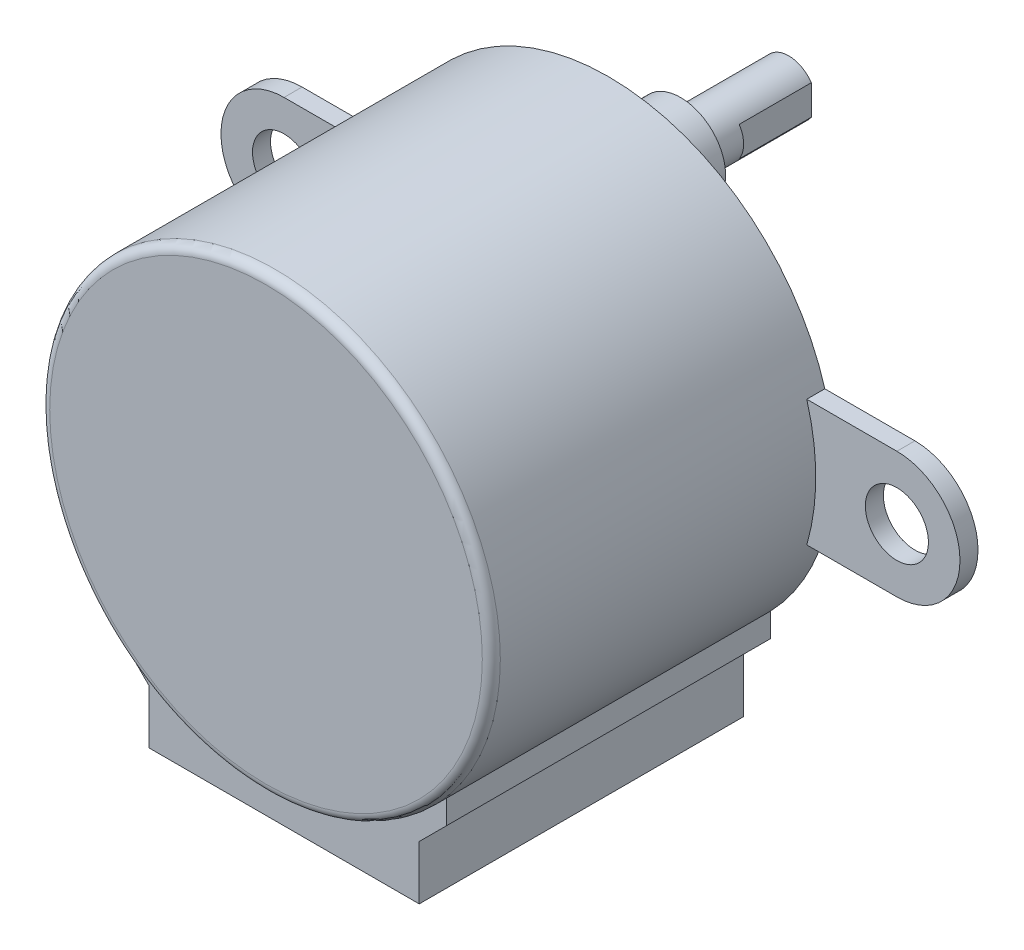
ISO-10303-21;
HEADER;
FILE_DESCRIPTION(('STEP AP214'),'2;1');
FILE_NAME('part.step','',(''),(''),'','','');
FILE_SCHEMA(('AUTOMOTIVE_DESIGN { 1 0 10303 214 1 1 1 1 }'));
ENDSEC;
DATA;
#1=APPLICATION_CONTEXT('core data for automotive mechanical design processes');
#2=APPLICATION_PROTOCOL_DEFINITION('international standard','automotive_design',2000,#1);
#3=PRODUCT_CONTEXT('',#1,'mechanical');
#4=PRODUCT('Part','Part','',(#3));
#5=PRODUCT_RELATED_PRODUCT_CATEGORY('part','',(#4));
#6=PRODUCT_DEFINITION_FORMATION('','',#4);
#7=PRODUCT_DEFINITION_CONTEXT('part definition',#1,'design');
#8=PRODUCT_DEFINITION('design','',#6,#7);
#9=PRODUCT_DEFINITION_SHAPE('','',#8);
#10=(LENGTH_UNIT() NAMED_UNIT(*) SI_UNIT(.MILLI.,.METRE.));
#11=(NAMED_UNIT(*) PLANE_ANGLE_UNIT() SI_UNIT($,.RADIAN.));
#12=(NAMED_UNIT(*) SI_UNIT($,.STERADIAN.) SOLID_ANGLE_UNIT());
#13=UNCERTAINTY_MEASURE_WITH_UNIT(LENGTH_MEASURE(1.E-05),#10,'distance_accuracy_value','');
#14=(GEOMETRIC_REPRESENTATION_CONTEXT(3) GLOBAL_UNCERTAINTY_ASSIGNED_CONTEXT((#13)) GLOBAL_UNIT_ASSIGNED_CONTEXT((#10,
#11,#12)) REPRESENTATION_CONTEXT('',''));
#15=CARTESIAN_POINT('',(0.,0.,0.));
#16=DIRECTION('',(0.,0.,1.));
#17=DIRECTION('',(1.,0.,0.));
#18=AXIS2_PLACEMENT_3D('',#15,#16,#17);
#19=CARTESIAN_POINT('',(0.,7.,-4.));
#20=DIRECTION('',(0.,0.,-1.));
#21=DIRECTION('',(-1.,0.,0.));
#22=AXIS2_PLACEMENT_3D('',#19,#20,#21);
#23=PLANE('',#22);
#24=CARTESIAN_POINT('',(0.,7.,-4.));
#25=DIRECTION('',(0.,0.,-1.));
#26=DIRECTION('',(-1.,0.,0.));
#27=AXIS2_PLACEMENT_3D('',#24,#25,#26);
#28=CIRCLE('',#27,2.5);
#29=CARTESIAN_POINT('',(-2.5,7.,-4.));
#30=VERTEX_POINT('',#29);
#31=EDGE_CURVE('E193',#30,#30,#28,.T.);
#32=ORIENTED_EDGE('',*,*,#31,.T.);
#33=EDGE_LOOP('',(#32));
#34=FACE_BOUND('',#33,.T.);
#35=CARTESIAN_POINT('',(0.,7.,-4.));
#36=DIRECTION('',(0.,0.,-1.));
#37=DIRECTION('',(-1.,0.,0.));
#38=AXIS2_PLACEMENT_3D('',#35,#36,#37);
#39=CIRCLE('',#38,1.5);
#40=CARTESIAN_POINT('',(-1.5,7.,-4.));
#41=VERTEX_POINT('',#40);
#42=EDGE_CURVE('E195',#41,#41,#39,.T.);
#43=ORIENTED_EDGE('',*,*,#42,.F.);
#44=EDGE_LOOP('',(#43));
#45=FACE_BOUND('',#44,.T.);
#46=ADVANCED_FACE('F33',(#34,#45),#23,.T.);
#47=CARTESIAN_POINT('',(0.,7.,-1.));
#48=DIRECTION('',(0.,0.,-1.));
#49=DIRECTION('',(-1.,0.,0.));
#50=AXIS2_PLACEMENT_3D('',#47,#48,#49);
#51=PLANE('',#50);
#52=CARTESIAN_POINT('',(0.,7.,-1.));
#53=DIRECTION('',(0.,0.,-1.));
#54=DIRECTION('',(-1.,0.,0.));
#55=AXIS2_PLACEMENT_3D('',#52,#53,#54);
#56=CIRCLE('',#55,3.);
#57=CARTESIAN_POINT('',(-3.,7.,-1.));
#58=VERTEX_POINT('',#57);
#59=EDGE_CURVE('E201',#58,#58,#56,.T.);
#60=ORIENTED_EDGE('',*,*,#59,.T.);
#61=EDGE_LOOP('',(#60));
#62=FACE_BOUND('',#61,.T.);
#63=CARTESIAN_POINT('',(0.,7.,-1.));
#64=DIRECTION('',(0.,0.,-1.));
#65=DIRECTION('',(-1.,0.,0.));
#66=AXIS2_PLACEMENT_3D('',#63,#64,#65);
#67=CIRCLE('',#66,2.5);
#68=CARTESIAN_POINT('',(-2.5,7.,-1.));
#69=VERTEX_POINT('',#68);
#70=EDGE_CURVE('E189',#69,#69,#67,.T.);
#71=ORIENTED_EDGE('',*,*,#70,.F.);
#72=EDGE_LOOP('',(#71));
#73=FACE_BOUND('',#72,.T.);
#74=ADVANCED_FACE('F371',(#62,#73),#51,.T.);
#75=CARTESIAN_POINT('',(0.,0.,0.));
#76=DIRECTION('',(0.,0.,1.));
#77=DIRECTION('',(1.,0.,0.));
#78=AXIS2_PLACEMENT_3D('',#75,#76,#77);
#79=PLANE('',#78);
#80=CARTESIAN_POINT('',(17.,0.,0.));
#81=DIRECTION('',(0.,0.,1.));
#82=DIRECTION('',(1.,0.,0.));
#83=AXIS2_PLACEMENT_3D('',#80,#81,#82);
#84=CIRCLE('',#83,1.75);
#85=CARTESIAN_POINT('',(18.75,0.,0.));
#86=VERTEX_POINT('',#85);
#87=EDGE_CURVE('E204',#86,#86,#84,.T.);
#88=ORIENTED_EDGE('',*,*,#87,.T.);
#89=EDGE_LOOP('',(#88));
#90=FACE_BOUND('',#89,.T.);
#91=CARTESIAN_POINT('',(-17.,0.,0.));
#92=DIRECTION('',(0.,0.,-1.));
#93=DIRECTION('',(-1.,0.,0.));
#94=AXIS2_PLACEMENT_3D('',#91,#92,#93);
#95=CIRCLE('',#94,1.75);
#96=CARTESIAN_POINT('',(-18.75,0.,0.));
#97=VERTEX_POINT('',#96);
#98=EDGE_CURVE('E233',#97,#97,#95,.T.);
#99=ORIENTED_EDGE('',*,*,#98,.F.);
#100=EDGE_LOOP('',(#99));
#101=FACE_BOUND('',#100,.T.);
#102=CARTESIAN_POINT('',(0.,0.,0.));
#103=DIRECTION('',(0.,0.,1.));
#104=DIRECTION('',(1.,0.,0.));
#105=AXIS2_PLACEMENT_3D('',#102,#103,#104);
#106=CIRCLE('',#105,12.5);
#107=CARTESIAN_POINT('',(9.,-8.67467578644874,0.));
#108=VERTEX_POINT('',#107);
#109=CARTESIAN_POINT('',(12.,-3.5,0.));
#110=VERTEX_POINT('',#109);
#111=EDGE_CURVE('E340',#108,#110,#106,.T.);
#112=ORIENTED_EDGE('',*,*,#111,.F.);
#113=DIRECTION('',(0.,-1.,0.));
#114=VECTOR('',#113,1.);
#115=CARTESIAN_POINT('',(9.,-8.67467578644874,0.));
#116=LINE('',#115,#114);
#117=CARTESIAN_POINT('',(9.,-10.,0.));
#118=VERTEX_POINT('',#117);
#119=EDGE_CURVE('E278',#108,#118,#116,.T.);
#120=ORIENTED_EDGE('',*,*,#119,.T.);
#121=DIRECTION('',(-0.707106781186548,-0.707106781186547,0.));
#122=VECTOR('',#121,1.);
#123=CARTESIAN_POINT('',(9.,-10.,0.));
#124=LINE('',#123,#122);
#125=CARTESIAN_POINT('',(7.5,-11.5,0.));
#126=VERTEX_POINT('',#125);
#127=EDGE_CURVE('E270',#118,#126,#124,.T.);
#128=ORIENTED_EDGE('',*,*,#127,.T.);
#129=DIRECTION('',(0.,-1.,0.));
#130=VECTOR('',#129,1.);
#131=CARTESIAN_POINT('',(7.5,-11.5,0.));
#132=LINE('',#131,#130);
#133=CARTESIAN_POINT('',(7.5,-14.5,0.));
#134=VERTEX_POINT('',#133);
#135=EDGE_CURVE('E294',#126,#134,#132,.T.);
#136=ORIENTED_EDGE('',*,*,#135,.T.);
#137=DIRECTION('',(-1.,0.,0.));
#138=VECTOR('',#137,1.);
#139=CARTESIAN_POINT('',(7.5,-14.5,0.));
#140=LINE('',#139,#138);
#141=CARTESIAN_POINT('',(-7.5,-14.5,0.));
#142=VERTEX_POINT('',#141);
#143=EDGE_CURVE('E291',#134,#142,#140,.T.);
#144=ORIENTED_EDGE('',*,*,#143,.T.);
#145=DIRECTION('',(0.,1.,0.));
#146=VECTOR('',#145,1.);
#147=CARTESIAN_POINT('',(-7.5,-11.5,0.));
#148=LINE('',#147,#146);
#149=CARTESIAN_POINT('',(-7.5,-11.5,0.));
#150=VERTEX_POINT('',#149);
#151=EDGE_CURVE('E288',#142,#150,#148,.T.);
#152=ORIENTED_EDGE('',*,*,#151,.T.);
#153=DIRECTION('',(-0.707106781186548,0.707106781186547,0.));
#154=VECTOR('',#153,1.);
#155=CARTESIAN_POINT('',(-9.,-10.,0.));
#156=LINE('',#155,#154);
#157=CARTESIAN_POINT('',(-9.,-10.,0.));
#158=VERTEX_POINT('',#157);
#159=EDGE_CURVE('E285',#150,#158,#156,.T.);
#160=ORIENTED_EDGE('',*,*,#159,.T.);
#161=DIRECTION('',(0.,1.,0.));
#162=VECTOR('',#161,1.);
#163=CARTESIAN_POINT('',(-9.,-8.67467578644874,0.));
#164=LINE('',#163,#162);
#165=CARTESIAN_POINT('',(-9.,-8.67467578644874,0.));
#166=VERTEX_POINT('',#165);
#167=EDGE_CURVE('E282',#158,#166,#164,.T.);
#168=ORIENTED_EDGE('',*,*,#167,.T.);
#169=CARTESIAN_POINT('',(-12.,-3.50000000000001,0.));
#170=VERTEX_POINT('',#169);
#171=EDGE_CURVE('E339',#170,#166,#106,.T.);
#172=ORIENTED_EDGE('',*,*,#171,.F.);
#173=DIRECTION('',(-1.,0.,0.));
#174=VECTOR('',#173,1.);
#175=CARTESIAN_POINT('',(-17.,-3.5,0.));
#176=LINE('',#175,#174);
#177=CARTESIAN_POINT('',(-17.,-3.5,0.));
#178=VERTEX_POINT('',#177);
#179=EDGE_CURVE('E253',#170,#178,#176,.T.);
#180=ORIENTED_EDGE('',*,*,#179,.T.);
#181=CARTESIAN_POINT('',(-17.,0.,0.));
#182=DIRECTION('',(0.,0.,-1.));
#183=DIRECTION('',(-1.,0.,0.));
#184=AXIS2_PLACEMENT_3D('',#181,#182,#183);
#185=CIRCLE('',#184,3.5);
#186=CARTESIAN_POINT('',(-17.,3.5,0.));
#187=VERTEX_POINT('',#186);
#188=EDGE_CURVE('E247',#178,#187,#185,.T.);
#189=ORIENTED_EDGE('',*,*,#188,.T.);
#190=DIRECTION('',(1.,0.,0.));
#191=VECTOR('',#190,1.);
#192=CARTESIAN_POINT('',(-17.,3.5,0.));
#193=LINE('',#192,#191);
#194=CARTESIAN_POINT('',(-12.,3.5,0.));
#195=VERTEX_POINT('',#194);
#196=EDGE_CURVE('E250',#187,#195,#193,.T.);
#197=ORIENTED_EDGE('',*,*,#196,.T.);
#198=CARTESIAN_POINT('',(12.,3.5,0.));
#199=VERTEX_POINT('',#198);
#200=EDGE_CURVE('E343',#199,#195,#106,.T.);
#201=ORIENTED_EDGE('',*,*,#200,.F.);
#202=DIRECTION('',(-1.,0.,0.));
#203=VECTOR('',#202,1.);
#204=CARTESIAN_POINT('',(17.,3.5,0.));
#205=LINE('',#204,#203);
#206=CARTESIAN_POINT('',(17.,3.5,0.));
#207=VERTEX_POINT('',#206);
#208=EDGE_CURVE('E215',#207,#199,#205,.T.);
#209=ORIENTED_EDGE('',*,*,#208,.F.);
#210=CARTESIAN_POINT('',(17.,0.,0.));
#211=DIRECTION('',(0.,0.,1.));
#212=DIRECTION('',(1.,0.,0.));
#213=AXIS2_PLACEMENT_3D('',#210,#211,#212);
#214=CIRCLE('',#213,3.5);
#215=CARTESIAN_POINT('',(17.,-3.5,0.));
#216=VERTEX_POINT('',#215);
#217=EDGE_CURVE('E210',#216,#207,#214,.T.);
#218=ORIENTED_EDGE('',*,*,#217,.F.);
#219=DIRECTION('',(1.,0.,0.));
#220=VECTOR('',#219,1.);
#221=CARTESIAN_POINT('',(17.,-3.5,0.));
#222=LINE('',#221,#220);
#223=EDGE_CURVE('E213',#110,#216,#222,.T.);
#224=ORIENTED_EDGE('',*,*,#223,.F.);
#225=EDGE_LOOP('',(#112,#120,#128,#136,#144,#152,#160,#168,#172,#180,#189,#197,#201,#209,#218,#224));
#226=FACE_BOUND('',#225,.T.);
#227=CARTESIAN_POINT('',(0.,7.,0.));
#228=DIRECTION('',(0.,0.,1.));
#229=DIRECTION('',(1.,0.,0.));
#230=AXIS2_PLACEMENT_3D('',#227,#228,#229);
#231=CIRCLE('',#230,3.);
#232=CARTESIAN_POINT('',(3.,7.,0.));
#233=VERTEX_POINT('',#232);
#234=EDGE_CURVE('E12',#233,#233,#231,.F.);
#235=ORIENTED_EDGE('',*,*,#234,.F.);
#236=EDGE_LOOP('',(#235));
#237=FACE_BOUND('',#236,.T.);
#238=ADVANCED_FACE('F368',(#90,#101,#226,#237),#79,.F.);
#239=CARTESIAN_POINT('',(0.,0.,19.));
#240=DIRECTION('',(0.,0.,-1.));
#241=DIRECTION('',(-1.,0.,0.));
#242=AXIS2_PLACEMENT_3D('',#239,#240,#241);
#243=CYLINDRICAL_SURFACE('',#242,12.5);
#244=CARTESIAN_POINT('',(0.,0.,18.5));
#245=DIRECTION('',(0.,0.,1.));
#246=DIRECTION('',(1.,0.,0.));
#247=AXIS2_PLACEMENT_3D('',#244,#245,#246);
#248=CIRCLE('',#247,12.5);
#249=CARTESIAN_POINT('',(12.5,0.,18.5));
#250=VERTEX_POINT('',#249);
#251=EDGE_CURVE('E41',#250,#250,#248,.F.);
#252=ORIENTED_EDGE('',*,*,#251,.T.);
#253=EDGE_LOOP('',(#252));
#254=FACE_BOUND('',#253,.T.);
#255=DIRECTION('',(0.,0.,-1.));
#256=VECTOR('',#255,1.);
#257=CARTESIAN_POINT('',(12.,3.5,1.));
#258=LINE('',#257,#256);
#259=CARTESIAN_POINT('',(12.,3.5,1.));
#260=VERTEX_POINT('',#259);
#261=EDGE_CURVE('E234',#260,#199,#258,.T.);
#262=ORIENTED_EDGE('',*,*,#261,.T.);
#263=ORIENTED_EDGE('',*,*,#200,.T.);
#264=DIRECTION('',(0.,0.,-1.));
#265=VECTOR('',#264,1.);
#266=CARTESIAN_POINT('',(-12.,3.5,1.));
#267=LINE('',#266,#265);
#268=CARTESIAN_POINT('',(-12.,3.5,1.));
#269=VERTEX_POINT('',#268);
#270=EDGE_CURVE('E274',#269,#195,#267,.T.);
#271=ORIENTED_EDGE('',*,*,#270,.F.);
#272=CARTESIAN_POINT('',(0.,0.,1.));
#273=DIRECTION('',(0.,0.,1.));
#274=DIRECTION('',(-1.,0.,0.));
#275=AXIS2_PLACEMENT_3D('',#272,#273,#274);
#276=CIRCLE('',#275,12.5);
#277=CARTESIAN_POINT('',(-12.,-3.5,1.));
#278=VERTEX_POINT('',#277);
#279=EDGE_CURVE('E262',#269,#278,#276,.T.);
#280=ORIENTED_EDGE('',*,*,#279,.T.);
#281=DIRECTION('',(0.,0.,-1.));
#282=VECTOR('',#281,1.);
#283=CARTESIAN_POINT('',(-12.,-3.50000000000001,1.));
#284=LINE('',#283,#282);
#285=EDGE_CURVE('E271',#278,#170,#284,.T.);
#286=ORIENTED_EDGE('',*,*,#285,.T.);
#287=ORIENTED_EDGE('',*,*,#171,.T.);
#288=DIRECTION('',(0.,0.,-1.));
#289=VECTOR('',#288,1.);
#290=CARTESIAN_POINT('',(-9.,-8.67467578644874,37.9191543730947));
#291=LINE('',#290,#289);
#292=CARTESIAN_POINT('',(-9.,-8.67467578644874,18.));
#293=VERTEX_POINT('',#292);
#294=EDGE_CURVE('E313',#293,#166,#291,.T.);
#295=ORIENTED_EDGE('',*,*,#294,.F.);
#296=CARTESIAN_POINT('',(0.,0.,18.));
#297=DIRECTION('',(0.,0.,1.));
#298=DIRECTION('',(1.,0.,0.));
#299=AXIS2_PLACEMENT_3D('',#296,#297,#298);
#300=CIRCLE('',#299,12.5);
#301=CARTESIAN_POINT('',(9.,-8.67467578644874,18.));
#302=VERTEX_POINT('',#301);
#303=EDGE_CURVE('E311',#293,#302,#300,.T.);
#304=ORIENTED_EDGE('',*,*,#303,.T.);
#305=DIRECTION('',(0.,0.,-1.));
#306=VECTOR('',#305,1.);
#307=CARTESIAN_POINT('',(9.,-8.67467578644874,37.9191543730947));
#308=LINE('',#307,#306);
#309=EDGE_CURVE('E310',#302,#108,#308,.T.);
#310=ORIENTED_EDGE('',*,*,#309,.T.);
#311=ORIENTED_EDGE('',*,*,#111,.T.);
#312=DIRECTION('',(0.,0.,-1.));
#313=VECTOR('',#312,1.);
#314=CARTESIAN_POINT('',(12.,-3.50000000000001,1.));
#315=LINE('',#314,#313);
#316=CARTESIAN_POINT('',(12.,-3.5,0.999999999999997));
#317=VERTEX_POINT('',#316);
#318=EDGE_CURVE('E237',#317,#110,#315,.T.);
#319=ORIENTED_EDGE('',*,*,#318,.F.);
#320=CARTESIAN_POINT('',(0.,0.,1.));
#321=DIRECTION('',(0.,0.,-1.));
#322=DIRECTION('',(1.,0.,0.));
#323=AXIS2_PLACEMENT_3D('',#320,#321,#322);
#324=CIRCLE('',#323,12.5);
#325=EDGE_CURVE('E223',#260,#317,#324,.T.);
#326=ORIENTED_EDGE('',*,*,#325,.F.);
#327=EDGE_LOOP('',(#262,#263,#271,#280,#286,#287,#295,#304,#310,#311,#319,#326));
#328=FACE_BOUND('',#327,.T.);
#329=ADVANCED_FACE('F35',(#254,#328),#243,.T.);
#330=CARTESIAN_POINT('',(0.,0.,19.));
#331=DIRECTION('',(0.,0.,1.));
#332=DIRECTION('',(1.,0.,0.));
#333=AXIS2_PLACEMENT_3D('',#330,#331,#332);
#334=PLANE('',#333);
#335=CARTESIAN_POINT('',(0.,0.,19.));
#336=DIRECTION('',(0.,0.,1.));
#337=DIRECTION('',(1.,0.,0.));
#338=AXIS2_PLACEMENT_3D('',#335,#336,#337);
#339=CIRCLE('',#338,12.);
#340=CARTESIAN_POINT('',(12.,0.,19.));
#341=VERTEX_POINT('',#340);
#342=EDGE_CURVE('E342',#341,#341,#339,.T.);
#343=ORIENTED_EDGE('',*,*,#342,.T.);
#344=EDGE_LOOP('',(#343));
#345=FACE_BOUND('',#344,.T.);
#346=ADVANCED_FACE('F358',(#345),#334,.T.);
#347=CARTESIAN_POINT('',(0.,0.,18.));
#348=DIRECTION('',(0.,0.,1.));
#349=DIRECTION('',(1.,0.,0.));
#350=AXIS2_PLACEMENT_3D('',#347,#348,#349);
#351=PLANE('',#350);
#352=DIRECTION('',(-0.707106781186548,-0.707106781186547,0.));
#353=VECTOR('',#352,1.);
#354=CARTESIAN_POINT('',(9.,-10.,18.));
#355=LINE('',#354,#353);
#356=CARTESIAN_POINT('',(9.,-10.,18.));
#357=VERTEX_POINT('',#356);
#358=CARTESIAN_POINT('',(7.5,-11.5,18.));
#359=VERTEX_POINT('',#358);
#360=EDGE_CURVE('E302',#357,#359,#355,.T.);
#361=ORIENTED_EDGE('',*,*,#360,.F.);
#362=DIRECTION('',(0.,-1.,0.));
#363=VECTOR('',#362,1.);
#364=CARTESIAN_POINT('',(9.,-8.67467578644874,18.));
#365=LINE('',#364,#363);
#366=EDGE_CURVE('E307',#302,#357,#365,.T.);
#367=ORIENTED_EDGE('',*,*,#366,.F.);
#368=ORIENTED_EDGE('',*,*,#303,.F.);
#369=DIRECTION('',(0.,1.,0.));
#370=VECTOR('',#369,1.);
#371=CARTESIAN_POINT('',(-9.,-8.67467578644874,18.));
#372=LINE('',#371,#370);
#373=CARTESIAN_POINT('',(-9.,-10.,18.));
#374=VERTEX_POINT('',#373);
#375=EDGE_CURVE('E314',#374,#293,#372,.T.);
#376=ORIENTED_EDGE('',*,*,#375,.F.);
#377=DIRECTION('',(-0.707106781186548,0.707106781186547,0.));
#378=VECTOR('',#377,1.);
#379=CARTESIAN_POINT('',(-9.,-10.,18.));
#380=LINE('',#379,#378);
#381=CARTESIAN_POINT('',(-7.5,-11.5,18.));
#382=VERTEX_POINT('',#381);
#383=EDGE_CURVE('E318',#382,#374,#380,.T.);
#384=ORIENTED_EDGE('',*,*,#383,.F.);
#385=DIRECTION('',(0.,1.,0.));
#386=VECTOR('',#385,1.);
#387=CARTESIAN_POINT('',(-7.5,-11.5,18.));
#388=LINE('',#387,#386);
#389=CARTESIAN_POINT('',(-7.5,-14.5,18.));
#390=VERTEX_POINT('',#389);
#391=EDGE_CURVE('E322',#390,#382,#388,.T.);
#392=ORIENTED_EDGE('',*,*,#391,.F.);
#393=DIRECTION('',(-1.,0.,0.));
#394=VECTOR('',#393,1.);
#395=CARTESIAN_POINT('',(7.5,-14.5,18.));
#396=LINE('',#395,#394);
#397=CARTESIAN_POINT('',(7.5,-14.5,18.));
#398=VERTEX_POINT('',#397);
#399=EDGE_CURVE('E326',#398,#390,#396,.T.);
#400=ORIENTED_EDGE('',*,*,#399,.F.);
#401=DIRECTION('',(0.,-1.,0.));
#402=VECTOR('',#401,1.);
#403=CARTESIAN_POINT('',(7.5,-11.5,18.));
#404=LINE('',#403,#402);
#405=EDGE_CURVE('E281',#359,#398,#404,.T.);
#406=ORIENTED_EDGE('',*,*,#405,.F.);
#407=EDGE_LOOP('',(#361,#367,#368,#376,#384,#392,#400,#406));
#408=FACE_BOUND('',#407,.T.);
#409=ADVANCED_FACE('F360',(#408),#351,.T.);
#410=CARTESIAN_POINT('',(7.5,-11.5,37.9191543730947));
#411=DIRECTION('',(1.,0.,0.));
#412=DIRECTION('',(0.,0.,-1.));
#413=AXIS2_PLACEMENT_3D('',#410,#411,#412);
#414=PLANE('',#413);
#415=DIRECTION('',(0.,0.,-1.));
#416=VECTOR('',#415,1.);
#417=CARTESIAN_POINT('',(7.5,-11.5,37.9191543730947));
#418=LINE('',#417,#416);
#419=EDGE_CURVE('E305',#359,#126,#418,.T.);
#420=ORIENTED_EDGE('',*,*,#419,.F.);
#421=ORIENTED_EDGE('',*,*,#405,.T.);
#422=DIRECTION('',(0.,0.,-1.));
#423=VECTOR('',#422,1.);
#424=CARTESIAN_POINT('',(7.5,-14.5,37.9191543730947));
#425=LINE('',#424,#423);
#426=EDGE_CURVE('E301',#398,#134,#425,.T.);
#427=ORIENTED_EDGE('',*,*,#426,.T.);
#428=ORIENTED_EDGE('',*,*,#135,.F.);
#429=EDGE_LOOP('',(#420,#421,#427,#428));
#430=FACE_BOUND('',#429,.T.);
#431=ADVANCED_FACE('F365',(#430),#414,.T.);
#432=CARTESIAN_POINT('',(7.5,-14.5,37.9191543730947));
#433=DIRECTION('',(0.,-1.,0.));
#434=DIRECTION('',(1.,0.,0.));
#435=AXIS2_PLACEMENT_3D('',#432,#433,#434);
#436=PLANE('',#435);
#437=ORIENTED_EDGE('',*,*,#426,.F.);
#438=ORIENTED_EDGE('',*,*,#399,.T.);
#439=DIRECTION('',(0.,0.,-1.));
#440=VECTOR('',#439,1.);
#441=CARTESIAN_POINT('',(-7.5,-14.5,37.9191543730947));
#442=LINE('',#441,#440);
#443=EDGE_CURVE('E325',#390,#142,#442,.T.);
#444=ORIENTED_EDGE('',*,*,#443,.T.);
#445=ORIENTED_EDGE('',*,*,#143,.F.);
#446=EDGE_LOOP('',(#437,#438,#444,#445));
#447=FACE_BOUND('',#446,.T.);
#448=ADVANCED_FACE('F448',(#447),#436,.T.);
#449=CARTESIAN_POINT('',(-7.5,-11.5,37.9191543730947));
#450=DIRECTION('',(-1.,0.,0.));
#451=DIRECTION('',(0.,0.,1.));
#452=AXIS2_PLACEMENT_3D('',#449,#450,#451);
#453=PLANE('',#452);
#454=ORIENTED_EDGE('',*,*,#443,.F.);
#455=ORIENTED_EDGE('',*,*,#391,.T.);
#456=DIRECTION('',(0.,0.,-1.));
#457=VECTOR('',#456,1.);
#458=CARTESIAN_POINT('',(-7.5,-11.5,37.9191543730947));
#459=LINE('',#458,#457);
#460=EDGE_CURVE('E321',#382,#150,#459,.T.);
#461=ORIENTED_EDGE('',*,*,#460,.T.);
#462=ORIENTED_EDGE('',*,*,#151,.F.);
#463=EDGE_LOOP('',(#454,#455,#461,#462));
#464=FACE_BOUND('',#463,.T.);
#465=ADVANCED_FACE('F444',(#464),#453,.T.);
#466=CARTESIAN_POINT('',(-9.,-10.,37.9191543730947));
#467=DIRECTION('',(-0.707106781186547,-0.707106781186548,0.));
#468=DIRECTION('',(0.707106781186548,-0.707106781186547,0.));
#469=AXIS2_PLACEMENT_3D('',#466,#467,#468);
#470=PLANE('',#469);
#471=ORIENTED_EDGE('',*,*,#460,.F.);
#472=ORIENTED_EDGE('',*,*,#383,.T.);
#473=DIRECTION('',(0.,0.,-1.));
#474=VECTOR('',#473,1.);
#475=CARTESIAN_POINT('',(-9.,-10.,37.9191543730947));
#476=LINE('',#475,#474);
#477=EDGE_CURVE('E317',#374,#158,#476,.T.);
#478=ORIENTED_EDGE('',*,*,#477,.T.);
#479=ORIENTED_EDGE('',*,*,#159,.F.);
#480=EDGE_LOOP('',(#471,#472,#478,#479));
#481=FACE_BOUND('',#480,.T.);
#482=ADVANCED_FACE('F440',(#481),#470,.T.);
#483=CARTESIAN_POINT('',(-9.,-8.67467578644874,37.9191543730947));
#484=DIRECTION('',(-1.,0.,0.));
#485=DIRECTION('',(0.,0.,1.));
#486=AXIS2_PLACEMENT_3D('',#483,#484,#485);
#487=PLANE('',#486);
#488=ORIENTED_EDGE('',*,*,#477,.F.);
#489=ORIENTED_EDGE('',*,*,#375,.T.);
#490=ORIENTED_EDGE('',*,*,#294,.T.);
#491=ORIENTED_EDGE('',*,*,#167,.F.);
#492=EDGE_LOOP('',(#488,#489,#490,#491));
#493=FACE_BOUND('',#492,.T.);
#494=ADVANCED_FACE('F436',(#493),#487,.T.);
#495=CARTESIAN_POINT('',(9.,-8.67467578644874,37.9191543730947));
#496=DIRECTION('',(1.,0.,0.));
#497=DIRECTION('',(0.,0.,-1.));
#498=AXIS2_PLACEMENT_3D('',#495,#496,#497);
#499=PLANE('',#498);
#500=ORIENTED_EDGE('',*,*,#309,.F.);
#501=ORIENTED_EDGE('',*,*,#366,.T.);
#502=DIRECTION('',(0.,0.,-1.));
#503=VECTOR('',#502,1.);
#504=CARTESIAN_POINT('',(9.,-10.,37.9191543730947));
#505=LINE('',#504,#503);
#506=EDGE_CURVE('E306',#357,#118,#505,.T.);
#507=ORIENTED_EDGE('',*,*,#506,.T.);
#508=ORIENTED_EDGE('',*,*,#119,.F.);
#509=EDGE_LOOP('',(#500,#501,#507,#508));
#510=FACE_BOUND('',#509,.T.);
#511=ADVANCED_FACE('F432',(#510),#499,.T.);
#512=CARTESIAN_POINT('',(9.,-10.,37.9191543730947));
#513=DIRECTION('',(0.707106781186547,-0.707106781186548,0.));
#514=DIRECTION('',(0.707106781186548,0.707106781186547,0.));
#515=AXIS2_PLACEMENT_3D('',#512,#513,#514);
#516=PLANE('',#515);
#517=ORIENTED_EDGE('',*,*,#506,.F.);
#518=ORIENTED_EDGE('',*,*,#360,.T.);
#519=ORIENTED_EDGE('',*,*,#419,.T.);
#520=ORIENTED_EDGE('',*,*,#127,.F.);
#521=EDGE_LOOP('',(#517,#518,#519,#520));
#522=FACE_BOUND('',#521,.T.);
#523=ADVANCED_FACE('F354',(#522),#516,.T.);
#524=CARTESIAN_POINT('',(0.,0.,18.5));
#525=DIRECTION('',(0.,0.,1.));
#526=DIRECTION('',(1.,0.,0.));
#527=AXIS2_PLACEMENT_3D('',#524,#525,#526);
#528=TOROIDAL_SURFACE('',#527,12.,0.5);
#529=ORIENTED_EDGE('',*,*,#251,.F.);
#530=EDGE_LOOP('',(#529));
#531=FACE_BOUND('',#530,.T.);
#532=ORIENTED_EDGE('',*,*,#342,.F.);
#533=EDGE_LOOP('',(#532));
#534=FACE_BOUND('',#533,.T.);
#535=ADVANCED_FACE('F350',(#531,#534),#528,.T.);
#536=CARTESIAN_POINT('',(-17.,0.,1.));
#537=DIRECTION('',(0.,0.,-1.));
#538=DIRECTION('',(-1.,0.,0.));
#539=AXIS2_PLACEMENT_3D('',#536,#537,#538);
#540=CYLINDRICAL_SURFACE('',#539,3.5);
#541=ORIENTED_EDGE('',*,*,#188,.F.);
#542=DIRECTION('',(0.,0.,-1.));
#543=VECTOR('',#542,1.);
#544=CARTESIAN_POINT('',(-17.,-3.5,1.));
#545=LINE('',#544,#543);
#546=CARTESIAN_POINT('',(-17.,-3.5,1.));
#547=VERTEX_POINT('',#546);
#548=EDGE_CURVE('E268',#547,#178,#545,.T.);
#549=ORIENTED_EDGE('',*,*,#548,.F.);
#550=CARTESIAN_POINT('',(-17.,0.,1.));
#551=DIRECTION('',(0.,0.,-1.));
#552=DIRECTION('',(-1.,0.,0.));
#553=AXIS2_PLACEMENT_3D('',#550,#551,#552);
#554=CIRCLE('',#553,3.5);
#555=CARTESIAN_POINT('',(-17.,3.5,1.));
#556=VERTEX_POINT('',#555);
#557=EDGE_CURVE('E256',#547,#556,#554,.T.);
#558=ORIENTED_EDGE('',*,*,#557,.T.);
#559=DIRECTION('',(0.,0.,-1.));
#560=VECTOR('',#559,1.);
#561=CARTESIAN_POINT('',(-17.,3.5,1.));
#562=LINE('',#561,#560);
#563=EDGE_CURVE('E267',#556,#187,#562,.T.);
#564=ORIENTED_EDGE('',*,*,#563,.T.);
#565=EDGE_LOOP('',(#541,#549,#558,#564));
#566=FACE_BOUND('',#565,.T.);
#567=ADVANCED_FACE('F353',(#566),#540,.T.);
#568=CARTESIAN_POINT('',(-17.,-3.5,1.));
#569=DIRECTION('',(0.,-1.,0.));
#570=DIRECTION('',(1.,0.,0.));
#571=AXIS2_PLACEMENT_3D('',#568,#569,#570);
#572=PLANE('',#571);
#573=ORIENTED_EDGE('',*,*,#179,.F.);
#574=ORIENTED_EDGE('',*,*,#285,.F.);
#575=DIRECTION('',(-1.,0.,0.));
#576=VECTOR('',#575,1.);
#577=CARTESIAN_POINT('',(-17.,-3.5,1.));
#578=LINE('',#577,#576);
#579=EDGE_CURVE('E264',#278,#547,#578,.T.);
#580=ORIENTED_EDGE('',*,*,#579,.T.);
#581=ORIENTED_EDGE('',*,*,#548,.T.);
#582=EDGE_LOOP('',(#573,#574,#580,#581));
#583=FACE_BOUND('',#582,.T.);
#584=ADVANCED_FACE('F420',(#583),#572,.T.);
#585=CARTESIAN_POINT('',(-17.,3.5,1.));
#586=DIRECTION('',(0.,1.,0.));
#587=DIRECTION('',(-1.,0.,0.));
#588=AXIS2_PLACEMENT_3D('',#585,#586,#587);
#589=PLANE('',#588);
#590=ORIENTED_EDGE('',*,*,#196,.F.);
#591=ORIENTED_EDGE('',*,*,#563,.F.);
#592=DIRECTION('',(1.,0.,0.));
#593=VECTOR('',#592,1.);
#594=CARTESIAN_POINT('',(-17.,3.5,1.));
#595=LINE('',#594,#593);
#596=EDGE_CURVE('E259',#556,#269,#595,.T.);
#597=ORIENTED_EDGE('',*,*,#596,.T.);
#598=ORIENTED_EDGE('',*,*,#270,.T.);
#599=EDGE_LOOP('',(#590,#591,#597,#598));
#600=FACE_BOUND('',#599,.T.);
#601=ADVANCED_FACE('F418',(#600),#589,.T.);
#602=CARTESIAN_POINT('',(-17.,0.,1.));
#603=DIRECTION('',(0.,0.,-1.));
#604=DIRECTION('',(-1.,0.,0.));
#605=AXIS2_PLACEMENT_3D('',#602,#603,#604);
#606=PLANE('',#605);
#607=CARTESIAN_POINT('',(-17.,0.,1.));
#608=DIRECTION('',(0.,0.,-1.));
#609=DIRECTION('',(-1.,0.,0.));
#610=AXIS2_PLACEMENT_3D('',#607,#608,#609);
#611=CIRCLE('',#610,1.75);
#612=CARTESIAN_POINT('',(-18.75,0.,1.));
#613=VERTEX_POINT('',#612);
#614=EDGE_CURVE('E244',#613,#613,#611,.T.);
#615=ORIENTED_EDGE('',*,*,#614,.T.);
#616=EDGE_LOOP('',(#615));
#617=FACE_BOUND('',#616,.T.);
#618=ORIENTED_EDGE('',*,*,#557,.F.);
#619=ORIENTED_EDGE('',*,*,#579,.F.);
#620=ORIENTED_EDGE('',*,*,#279,.F.);
#621=ORIENTED_EDGE('',*,*,#596,.F.);
#622=EDGE_LOOP('',(#618,#619,#620,#621));
#623=FACE_BOUND('',#622,.T.);
#624=ADVANCED_FACE('F414',(#617,#623),#606,.F.);
#625=CARTESIAN_POINT('',(-17.,0.,1.));
#626=DIRECTION('',(0.,0.,-1.));
#627=DIRECTION('',(-1.,0.,0.));
#628=AXIS2_PLACEMENT_3D('',#625,#626,#627);
#629=CYLINDRICAL_SURFACE('',#628,1.75);
#630=ORIENTED_EDGE('',*,*,#614,.F.);
#631=EDGE_LOOP('',(#630));
#632=FACE_BOUND('',#631,.T.);
#633=ORIENTED_EDGE('',*,*,#98,.T.);
#634=EDGE_LOOP('',(#633));
#635=FACE_BOUND('',#634,.T.);
#636=ADVANCED_FACE('F400',(#632,#635),#629,.F.);
#637=CARTESIAN_POINT('',(17.,0.,1.));
#638=DIRECTION('',(0.,0.,-1.));
#639=DIRECTION('',(1.,0.,0.));
#640=AXIS2_PLACEMENT_3D('',#637,#638,#639);
#641=PLANE('',#640);
#642=CARTESIAN_POINT('',(17.,0.,1.));
#643=DIRECTION('',(0.,0.,1.));
#644=DIRECTION('',(1.,0.,0.));
#645=AXIS2_PLACEMENT_3D('',#642,#643,#644);
#646=CIRCLE('',#645,3.5);
#647=CARTESIAN_POINT('',(17.,-3.5,1.));
#648=VERTEX_POINT('',#647);
#649=CARTESIAN_POINT('',(17.,3.5,1.));
#650=VERTEX_POINT('',#649);
#651=EDGE_CURVE('E218',#648,#650,#646,.T.);
#652=ORIENTED_EDGE('',*,*,#651,.T.);
#653=DIRECTION('',(-1.,0.,0.));
#654=VECTOR('',#653,1.);
#655=CARTESIAN_POINT('',(17.,3.5,1.));
#656=LINE('',#655,#654);
#657=EDGE_CURVE('E226',#650,#260,#656,.T.);
#658=ORIENTED_EDGE('',*,*,#657,.T.);
#659=ORIENTED_EDGE('',*,*,#325,.T.);
#660=DIRECTION('',(1.,0.,0.));
#661=VECTOR('',#660,1.);
#662=CARTESIAN_POINT('',(17.,-3.5,1.));
#663=LINE('',#662,#661);
#664=EDGE_CURVE('E221',#317,#648,#663,.T.);
#665=ORIENTED_EDGE('',*,*,#664,.T.);
#666=EDGE_LOOP('',(#652,#658,#659,#665));
#667=FACE_BOUND('',#666,.T.);
#668=CARTESIAN_POINT('',(17.,0.,1.));
#669=DIRECTION('',(0.,0.,1.));
#670=DIRECTION('',(1.,0.,0.));
#671=AXIS2_PLACEMENT_3D('',#668,#669,#670);
#672=CIRCLE('',#671,1.75);
#673=CARTESIAN_POINT('',(18.75,0.,1.));
#674=VERTEX_POINT('',#673);
#675=EDGE_CURVE('E207',#674,#674,#672,.T.);
#676=ORIENTED_EDGE('',*,*,#675,.F.);
#677=EDGE_LOOP('',(#676));
#678=FACE_BOUND('',#677,.T.);
#679=ADVANCED_FACE('F396',(#667,#678),#641,.F.);
#680=CARTESIAN_POINT('',(17.,0.,1.));
#681=DIRECTION('',(0.,0.,-1.));
#682=DIRECTION('',(-1.,0.,0.));
#683=AXIS2_PLACEMENT_3D('',#680,#681,#682);
#684=CYLINDRICAL_SURFACE('',#683,3.5);
#685=ORIENTED_EDGE('',*,*,#217,.T.);
#686=DIRECTION('',(0.,0.,-1.));
#687=VECTOR('',#686,1.);
#688=CARTESIAN_POINT('',(17.,3.5,1.));
#689=LINE('',#688,#687);
#690=EDGE_CURVE('E230',#650,#207,#689,.T.);
#691=ORIENTED_EDGE('',*,*,#690,.F.);
#692=ORIENTED_EDGE('',*,*,#651,.F.);
#693=DIRECTION('',(0.,0.,-1.));
#694=VECTOR('',#693,1.);
#695=CARTESIAN_POINT('',(17.,-3.5,1.));
#696=LINE('',#695,#694);
#697=EDGE_CURVE('E229',#648,#216,#696,.T.);
#698=ORIENTED_EDGE('',*,*,#697,.T.);
#699=EDGE_LOOP('',(#685,#691,#692,#698));
#700=FACE_BOUND('',#699,.T.);
#701=ADVANCED_FACE('F399',(#700),#684,.T.);
#702=CARTESIAN_POINT('',(17.,3.5,1.));
#703=DIRECTION('',(0.,-1.,0.));
#704=DIRECTION('',(1.,0.,0.));
#705=AXIS2_PLACEMENT_3D('',#702,#703,#704);
#706=PLANE('',#705);
#707=ORIENTED_EDGE('',*,*,#208,.T.);
#708=ORIENTED_EDGE('',*,*,#261,.F.);
#709=ORIENTED_EDGE('',*,*,#657,.F.);
#710=ORIENTED_EDGE('',*,*,#690,.T.);
#711=EDGE_LOOP('',(#707,#708,#709,#710));
#712=FACE_BOUND('',#711,.T.);
#713=ADVANCED_FACE('F402',(#712),#706,.F.);
#714=CARTESIAN_POINT('',(17.,-3.5,1.));
#715=DIRECTION('',(0.,1.,0.));
#716=DIRECTION('',(-1.,0.,0.));
#717=AXIS2_PLACEMENT_3D('',#714,#715,#716);
#718=PLANE('',#717);
#719=ORIENTED_EDGE('',*,*,#223,.T.);
#720=ORIENTED_EDGE('',*,*,#697,.F.);
#721=ORIENTED_EDGE('',*,*,#664,.F.);
#722=ORIENTED_EDGE('',*,*,#318,.T.);
#723=EDGE_LOOP('',(#719,#720,#721,#722));
#724=FACE_BOUND('',#723,.T.);
#725=ADVANCED_FACE('F394',(#724),#718,.F.);
#726=CARTESIAN_POINT('',(17.,0.,1.));
#727=DIRECTION('',(0.,0.,-1.));
#728=DIRECTION('',(-1.,0.,0.));
#729=AXIS2_PLACEMENT_3D('',#726,#727,#728);
#730=CYLINDRICAL_SURFACE('',#729,1.75);
#731=ORIENTED_EDGE('',*,*,#675,.T.);
#732=EDGE_LOOP('',(#731));
#733=FACE_BOUND('',#732,.T.);
#734=ORIENTED_EDGE('',*,*,#87,.F.);
#735=EDGE_LOOP('',(#734));
#736=FACE_BOUND('',#735,.T.);
#737=ADVANCED_FACE('F390',(#733,#736),#730,.F.);
#738=CARTESIAN_POINT('',(0.,7.,-1.));
#739=DIRECTION('',(0.,0.,1.));
#740=DIRECTION('',(1.,0.,0.));
#741=AXIS2_PLACEMENT_3D('',#738,#739,#740);
#742=CYLINDRICAL_SURFACE('',#741,3.);
#743=ORIENTED_EDGE('',*,*,#59,.F.);
#744=EDGE_LOOP('',(#743));
#745=FACE_BOUND('',#744,.T.);
#746=ORIENTED_EDGE('',*,*,#234,.T.);
#747=EDGE_LOOP('',(#746));
#748=FACE_BOUND('',#747,.T.);
#749=ADVANCED_FACE('F385',(#745,#748),#742,.T.);
#750=CARTESIAN_POINT('',(0.,7.,-4.));
#751=DIRECTION('',(0.,0.,1.));
#752=DIRECTION('',(1.,0.,0.));
#753=AXIS2_PLACEMENT_3D('',#750,#751,#752);
#754=CYLINDRICAL_SURFACE('',#753,2.5);
#755=ORIENTED_EDGE('',*,*,#31,.F.);
#756=EDGE_LOOP('',(#755));
#757=FACE_BOUND('',#756,.T.);
#758=ORIENTED_EDGE('',*,*,#70,.T.);
#759=EDGE_LOOP('',(#758));
#760=FACE_BOUND('',#759,.T.);
#761=ADVANCED_FACE('F383',(#757,#760),#754,.T.);
#762=CARTESIAN_POINT('',(0.,7.,-10.));
#763=DIRECTION('',(0.,0.,1.));
#764=DIRECTION('',(1.,0.,0.));
#765=AXIS2_PLACEMENT_3D('',#762,#763,#764);
#766=CYLINDRICAL_SURFACE('',#765,1.5);
#767=CARTESIAN_POINT('',(0.,7.,-10.));
#768=DIRECTION('',(0.,0.,-1.));
#769=DIRECTION('',(-1.,0.,0.));
#770=AXIS2_PLACEMENT_3D('',#767,#768,#769);
#771=CIRCLE('',#770,1.5);
#772=CARTESIAN_POINT('',(-1.25,7.82915619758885,-10.));
#773=VERTEX_POINT('',#772);
#774=CARTESIAN_POINT('',(1.25,7.82915619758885,-10.));
#775=VERTEX_POINT('',#774);
#776=EDGE_CURVE('E190',#773,#775,#771,.T.);
#777=ORIENTED_EDGE('',*,*,#776,.F.);
#778=DIRECTION('',(0.,0.,-1.));
#779=VECTOR('',#778,1.);
#780=CARTESIAN_POINT('',(-1.25,7.82915619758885,-6.));
#781=LINE('',#780,#779);
#782=CARTESIAN_POINT('',(-1.25,7.82915619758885,-6.));
#783=VERTEX_POINT('',#782);
#784=EDGE_CURVE('E48',#783,#773,#781,.T.);
#785=ORIENTED_EDGE('',*,*,#784,.F.);
#786=CARTESIAN_POINT('',(0.,7.,-6.));
#787=DIRECTION('',(0.,0.,-1.));
#788=DIRECTION('',(-1.,0.,0.));
#789=AXIS2_PLACEMENT_3D('',#786,#787,#788);
#790=CIRCLE('',#789,1.5);
#791=CARTESIAN_POINT('',(-1.25,6.17084380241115,-6.));
#792=VERTEX_POINT('',#791);
#793=EDGE_CURVE('E178',#792,#783,#790,.T.);
#794=ORIENTED_EDGE('',*,*,#793,.F.);
#795=DIRECTION('',(0.,0.,-1.));
#796=VECTOR('',#795,1.);
#797=CARTESIAN_POINT('',(-1.25,6.17084380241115,-6.));
#798=LINE('',#797,#796);
#799=CARTESIAN_POINT('',(-1.25,6.17084380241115,-10.));
#800=VERTEX_POINT('',#799);
#801=EDGE_CURVE('E173',#792,#800,#798,.T.);
#802=ORIENTED_EDGE('',*,*,#801,.T.);
#803=CARTESIAN_POINT('',(1.25,6.17084380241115,-10.));
#804=VERTEX_POINT('',#803);
#805=EDGE_CURVE('E185',#804,#800,#771,.T.);
#806=ORIENTED_EDGE('',*,*,#805,.F.);
#807=DIRECTION('',(0.,0.,-1.));
#808=VECTOR('',#807,1.);
#809=CARTESIAN_POINT('',(1.25,6.17084380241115,-6.));
#810=LINE('',#809,#808);
#811=CARTESIAN_POINT('',(1.25,6.17084380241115,-6.));
#812=VERTEX_POINT('',#811);
#813=EDGE_CURVE('E56',#812,#804,#810,.T.);
#814=ORIENTED_EDGE('',*,*,#813,.F.);
#815=CARTESIAN_POINT('',(0.,7.,-6.));
#816=DIRECTION('',(0.,0.,-1.));
#817=DIRECTION('',(-1.,0.,0.));
#818=AXIS2_PLACEMENT_3D('',#815,#816,#817);
#819=CIRCLE('',#818,1.5);
#820=CARTESIAN_POINT('',(1.25,7.82915619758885,-6.));
#821=VERTEX_POINT('',#820);
#822=EDGE_CURVE('E635',#821,#812,#819,.T.);
#823=ORIENTED_EDGE('',*,*,#822,.F.);
#824=DIRECTION('',(0.,0.,-1.));
#825=VECTOR('',#824,1.);
#826=CARTESIAN_POINT('',(1.25,7.82915619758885,-6.));
#827=LINE('',#826,#825);
#828=EDGE_CURVE('E640',#821,#775,#827,.T.);
#829=ORIENTED_EDGE('',*,*,#828,.T.);
#830=EDGE_LOOP('',(#777,#785,#794,#802,#806,#814,#823,#829));
#831=FACE_BOUND('',#830,.T.);
#832=ORIENTED_EDGE('',*,*,#42,.T.);
#833=EDGE_LOOP('',(#832));
#834=FACE_BOUND('',#833,.T.);
#835=ADVANCED_FACE('F183',(#831,#834),#766,.T.);
#836=CARTESIAN_POINT('',(0.,7.,-10.));
#837=DIRECTION('',(0.,0.,-1.));
#838=DIRECTION('',(-1.,0.,0.));
#839=AXIS2_PLACEMENT_3D('',#836,#837,#838);
#840=PLANE('',#839);
#841=DIRECTION('',(0.,-1.,0.));
#842=VECTOR('',#841,1.);
#843=CARTESIAN_POINT('',(-1.25,7.82915619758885,-10.));
#844=LINE('',#843,#842);
#845=EDGE_CURVE('E170',#773,#800,#844,.T.);
#846=ORIENTED_EDGE('',*,*,#845,.F.);
#847=ORIENTED_EDGE('',*,*,#776,.T.);
#848=DIRECTION('',(0.,1.,0.));
#849=VECTOR('',#848,1.);
#850=CARTESIAN_POINT('',(1.25,7.82915619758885,-10.));
#851=LINE('',#850,#849);
#852=EDGE_CURVE('E186',#804,#775,#851,.T.);
#853=ORIENTED_EDGE('',*,*,#852,.F.);
#854=ORIENTED_EDGE('',*,*,#805,.T.);
#855=EDGE_LOOP('',(#846,#847,#853,#854));
#856=FACE_BOUND('',#855,.T.);
#857=ADVANCED_FACE('F188',(#856),#840,.T.);
#858=CARTESIAN_POINT('',(1.25,7.82915619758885,-6.));
#859=DIRECTION('',(-1.,0.,0.));
#860=DIRECTION('',(0.,0.,1.));
#861=AXIS2_PLACEMENT_3D('',#858,#859,#860);
#862=PLANE('',#861);
#863=ORIENTED_EDGE('',*,*,#852,.T.);
#864=ORIENTED_EDGE('',*,*,#828,.F.);
#865=DIRECTION('',(0.,1.,0.));
#866=VECTOR('',#865,1.);
#867=CARTESIAN_POINT('',(1.25,7.82915619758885,-6.));
#868=LINE('',#867,#866);
#869=EDGE_CURVE('E637',#812,#821,#868,.T.);
#870=ORIENTED_EDGE('',*,*,#869,.F.);
#871=ORIENTED_EDGE('',*,*,#813,.T.);
#872=EDGE_LOOP('',(#863,#864,#870,#871));
#873=FACE_BOUND('',#872,.T.);
#874=ADVANCED_FACE('F564',(#873),#862,.F.);
#875=CARTESIAN_POINT('',(0.,7.,-6.));
#876=DIRECTION('',(0.,0.,-1.));
#877=DIRECTION('',(-1.,0.,0.));
#878=AXIS2_PLACEMENT_3D('',#875,#876,#877);
#879=PLANE('',#878);
#880=ORIENTED_EDGE('',*,*,#822,.T.);
#881=ORIENTED_EDGE('',*,*,#869,.T.);
#882=EDGE_LOOP('',(#880,#881));
#883=FACE_BOUND('',#882,.T.);
#884=ADVANCED_FACE('F570',(#883),#879,.T.);
#885=CARTESIAN_POINT('',(-1.25,7.82915619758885,-6.));
#886=DIRECTION('',(1.,0.,0.));
#887=DIRECTION('',(0.,0.,-1.));
#888=AXIS2_PLACEMENT_3D('',#885,#886,#887);
#889=PLANE('',#888);
#890=ORIENTED_EDGE('',*,*,#845,.T.);
#891=ORIENTED_EDGE('',*,*,#801,.F.);
#892=DIRECTION('',(0.,-1.,0.));
#893=VECTOR('',#892,1.);
#894=CARTESIAN_POINT('',(-1.25,7.82915619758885,-6.));
#895=LINE('',#894,#893);
#896=EDGE_CURVE('E628',#783,#792,#895,.T.);
#897=ORIENTED_EDGE('',*,*,#896,.F.);
#898=ORIENTED_EDGE('',*,*,#784,.T.);
#899=EDGE_LOOP('',(#890,#891,#897,#898));
#900=FACE_BOUND('',#899,.T.);
#901=ADVANCED_FACE('F172',(#900),#889,.F.);
#902=CARTESIAN_POINT('',(0.,7.,-6.));
#903=DIRECTION('',(0.,0.,-1.));
#904=DIRECTION('',(-1.,0.,0.));
#905=AXIS2_PLACEMENT_3D('',#902,#903,#904);
#906=PLANE('',#905);
#907=ORIENTED_EDGE('',*,*,#793,.T.);
#908=ORIENTED_EDGE('',*,*,#896,.T.);
#909=EDGE_LOOP('',(#907,#908));
#910=FACE_BOUND('',#909,.T.);
#911=ADVANCED_FACE('F584',(#910),#906,.T.);
#912=CLOSED_SHELL('',(#46,#74,#238,#329,#346,#409,#431,#448,#465,#482,#494,#511,#523,#535,#567,
#584,#601,#624,#636,#679,#701,#713,#725,#737,#749,#761,#835,#857,#874,#884,#901,#911));
#913=MANIFOLD_SOLID_BREP('B2',#912);
#914=ADVANCED_BREP_SHAPE_REPRESENTATION('',(#18,#913),#14);
#915=SHAPE_DEFINITION_REPRESENTATION(#9,#914);
ENDSEC;
END-ISO-10303-21;
